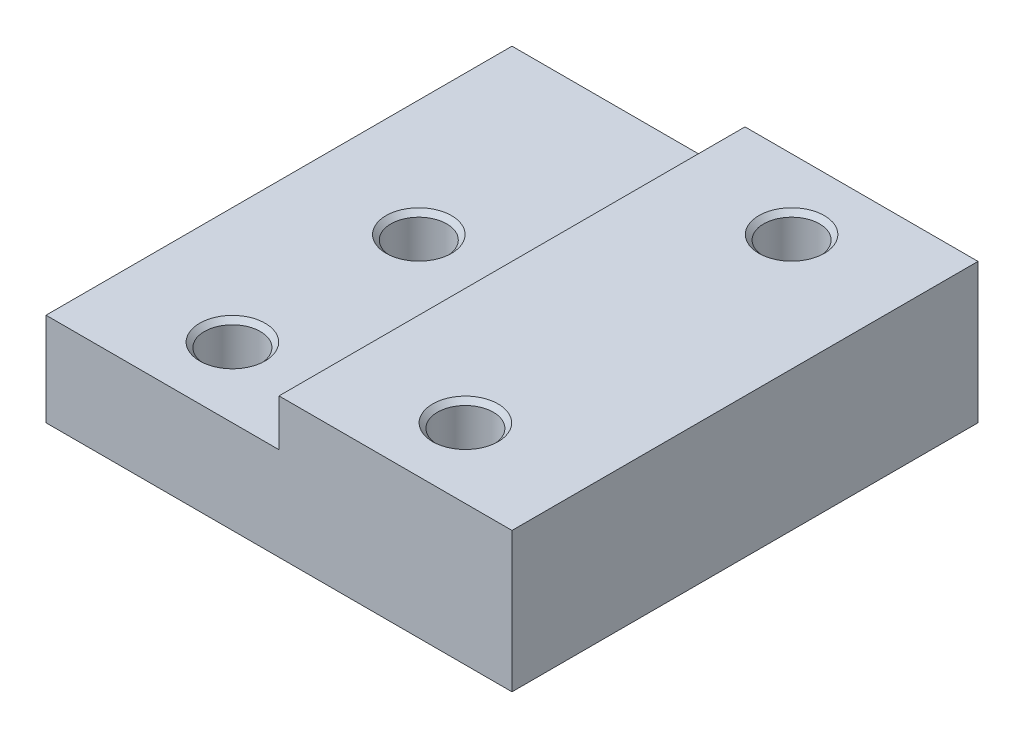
ISO-10303-21;
HEADER;
FILE_DESCRIPTION(('STEP AP214'),'2;1');
FILE_NAME('part.step','',(''),(''),'','','');
FILE_SCHEMA(('AUTOMOTIVE_DESIGN { 1 0 10303 214 1 1 1 1 }'));
ENDSEC;
DATA;
#1=APPLICATION_CONTEXT('core data for automotive mechanical design processes');
#2=APPLICATION_PROTOCOL_DEFINITION('international standard','automotive_design',2000,#1);
#3=PRODUCT_CONTEXT('',#1,'mechanical');
#4=PRODUCT('Part','Part','',(#3));
#5=PRODUCT_RELATED_PRODUCT_CATEGORY('part','',(#4));
#6=PRODUCT_DEFINITION_FORMATION('','',#4);
#7=PRODUCT_DEFINITION_CONTEXT('part definition',#1,'design');
#8=PRODUCT_DEFINITION('design','',#6,#7);
#9=PRODUCT_DEFINITION_SHAPE('','',#8);
#10=(LENGTH_UNIT() NAMED_UNIT(*) SI_UNIT(.MILLI.,.METRE.));
#11=(NAMED_UNIT(*) PLANE_ANGLE_UNIT() SI_UNIT($,.RADIAN.));
#12=(NAMED_UNIT(*) SI_UNIT($,.STERADIAN.) SOLID_ANGLE_UNIT());
#13=UNCERTAINTY_MEASURE_WITH_UNIT(LENGTH_MEASURE(1.E-05),#10,'distance_accuracy_value','');
#14=(GEOMETRIC_REPRESENTATION_CONTEXT(3) GLOBAL_UNCERTAINTY_ASSIGNED_CONTEXT((#13)) GLOBAL_UNIT_ASSIGNED_CONTEXT((#10,
#11,#12)) REPRESENTATION_CONTEXT('',''));
#15=CARTESIAN_POINT('',(0.,0.,0.));
#16=DIRECTION('',(0.,0.,1.));
#17=DIRECTION('',(1.,0.,0.));
#18=AXIS2_PLACEMENT_3D('',#15,#16,#17);
#19=CARTESIAN_POINT('',(0.,20.,100.));
#20=DIRECTION('',(1.,0.,0.));
#21=DIRECTION('',(0.,0.,-1.));
#22=AXIS2_PLACEMENT_3D('',#19,#20,#21);
#23=PLANE('',#22);
#24=DIRECTION('',(0.,-1.,0.));
#25=VECTOR('',#24,1.);
#26=CARTESIAN_POINT('',(0.,20.,0.));
#27=LINE('',#26,#25);
#28=CARTESIAN_POINT('',(0.,20.,0.));
#29=VERTEX_POINT('',#28);
#30=CARTESIAN_POINT('',(0.,0.,0.));
#31=VERTEX_POINT('',#30);
#32=EDGE_CURVE('E126',#29,#31,#27,.T.);
#33=ORIENTED_EDGE('',*,*,#32,.T.);
#34=DIRECTION('',(0.,0.,-1.));
#35=VECTOR('',#34,1.);
#36=CARTESIAN_POINT('',(0.,0.,100.));
#37=LINE('',#36,#35);
#38=CARTESIAN_POINT('',(0.,0.,100.));
#39=VERTEX_POINT('',#38);
#40=EDGE_CURVE('E11',#39,#31,#37,.T.);
#41=ORIENTED_EDGE('',*,*,#40,.F.);
#42=DIRECTION('',(0.,-1.,0.));
#43=VECTOR('',#42,1.);
#44=CARTESIAN_POINT('',(0.,20.,100.));
#45=LINE('',#44,#43);
#46=CARTESIAN_POINT('',(0.,20.,100.));
#47=VERTEX_POINT('',#46);
#48=EDGE_CURVE('E137',#47,#39,#45,.T.);
#49=ORIENTED_EDGE('',*,*,#48,.F.);
#50=DIRECTION('',(0.,0.,-1.));
#51=VECTOR('',#50,1.);
#52=CARTESIAN_POINT('',(0.,20.,100.));
#53=LINE('',#52,#51);
#54=EDGE_CURVE('E122',#47,#29,#53,.T.);
#55=ORIENTED_EDGE('',*,*,#54,.T.);
#56=EDGE_LOOP('',(#33,#41,#49,#55));
#57=FACE_BOUND('',#56,.T.);
#58=ADVANCED_FACE('F39',(#57),#23,.F.);
#59=CARTESIAN_POINT('',(0.,0.,100.));
#60=DIRECTION('',(0.,1.,0.));
#61=DIRECTION('',(0.,0.,1.));
#62=AXIS2_PLACEMENT_3D('',#59,#60,#61);
#63=PLANE('',#62);
#64=CARTESIAN_POINT('',(25.,0.,85.));
#65=DIRECTION('',(0.,1.,0.));
#66=DIRECTION('',(0.,0.,1.));
#67=AXIS2_PLACEMENT_3D('',#64,#65,#66);
#68=CIRCLE('',#67,5.99999999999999);
#69=CARTESIAN_POINT('',(25.,0.,91.));
#70=VERTEX_POINT('',#69);
#71=EDGE_CURVE('E365',#70,#70,#68,.T.);
#72=ORIENTED_EDGE('',*,*,#71,.T.);
#73=EDGE_LOOP('',(#72));
#74=FACE_BOUND('',#73,.T.);
#75=CARTESIAN_POINT('',(25.,0.,45.));
#76=DIRECTION('',(0.,1.,0.));
#77=DIRECTION('',(0.,0.,1.));
#78=AXIS2_PLACEMENT_3D('',#75,#76,#77);
#79=CIRCLE('',#78,5.99999999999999);
#80=CARTESIAN_POINT('',(25.,0.,51.));
#81=VERTEX_POINT('',#80);
#82=EDGE_CURVE('E375',#81,#81,#79,.T.);
#83=ORIENTED_EDGE('',*,*,#82,.T.);
#84=EDGE_LOOP('',(#83));
#85=FACE_BOUND('',#84,.T.);
#86=DIRECTION('',(1.,0.,0.));
#87=VECTOR('',#86,1.);
#88=CARTESIAN_POINT('',(0.,0.,0.));
#89=LINE('',#88,#87);
#90=CARTESIAN_POINT('',(100.,0.,0.));
#91=VERTEX_POINT('',#90);
#92=EDGE_CURVE('E129',#31,#91,#89,.T.);
#93=ORIENTED_EDGE('',*,*,#92,.T.);
#94=DIRECTION('',(0.,0.,-1.));
#95=VECTOR('',#94,1.);
#96=CARTESIAN_POINT('',(100.,0.,100.));
#97=LINE('',#96,#95);
#98=CARTESIAN_POINT('',(100.,0.,100.));
#99=VERTEX_POINT('',#98);
#100=EDGE_CURVE('E47',#99,#91,#97,.T.);
#101=ORIENTED_EDGE('',*,*,#100,.F.);
#102=DIRECTION('',(1.,0.,0.));
#103=VECTOR('',#102,1.);
#104=CARTESIAN_POINT('',(0.,0.,100.));
#105=LINE('',#104,#103);
#106=EDGE_CURVE('E93',#39,#99,#105,.T.);
#107=ORIENTED_EDGE('',*,*,#106,.F.);
#108=ORIENTED_EDGE('',*,*,#40,.T.);
#109=EDGE_LOOP('',(#93,#101,#107,#108));
#110=FACE_BOUND('',#109,.T.);
#111=ADVANCED_FACE('F164',(#74,#85,#110),#63,.F.);
#112=CARTESIAN_POINT('',(100.,0.,100.));
#113=DIRECTION('',(-1.,0.,0.));
#114=DIRECTION('',(0.,0.,1.));
#115=AXIS2_PLACEMENT_3D('',#112,#113,#114);
#116=PLANE('',#115);
#117=DIRECTION('',(0.,1.,0.));
#118=VECTOR('',#117,1.);
#119=CARTESIAN_POINT('',(100.,0.,0.));
#120=LINE('',#119,#118);
#121=CARTESIAN_POINT('',(100.,30.,0.));
#122=VERTEX_POINT('',#121);
#123=EDGE_CURVE('E132',#91,#122,#120,.T.);
#124=ORIENTED_EDGE('',*,*,#123,.T.);
#125=DIRECTION('',(0.,0.,-1.));
#126=VECTOR('',#125,1.);
#127=CARTESIAN_POINT('',(100.,30.,100.));
#128=LINE('',#127,#126);
#129=CARTESIAN_POINT('',(100.,30.,100.));
#130=VERTEX_POINT('',#129);
#131=EDGE_CURVE('E117',#130,#122,#128,.T.);
#132=ORIENTED_EDGE('',*,*,#131,.F.);
#133=DIRECTION('',(0.,1.,0.));
#134=VECTOR('',#133,1.);
#135=CARTESIAN_POINT('',(100.,0.,100.));
#136=LINE('',#135,#134);
#137=EDGE_CURVE('E108',#99,#130,#136,.T.);
#138=ORIENTED_EDGE('',*,*,#137,.F.);
#139=ORIENTED_EDGE('',*,*,#100,.T.);
#140=EDGE_LOOP('',(#124,#132,#138,#139));
#141=FACE_BOUND('',#140,.T.);
#142=ADVANCED_FACE('F143',(#141),#116,.F.);
#143=CARTESIAN_POINT('',(100.,30.,100.));
#144=DIRECTION('',(0.,-1.,0.));
#145=DIRECTION('',(1.,0.,0.));
#146=AXIS2_PLACEMENT_3D('',#143,#144,#145);
#147=PLANE('',#146);
#148=CARTESIAN_POINT('',(75.,30.,15.));
#149=DIRECTION('',(0.,1.,0.));
#150=DIRECTION('',(0.,0.,1.));
#151=AXIS2_PLACEMENT_3D('',#148,#149,#150);
#152=CIRCLE('',#151,7.025);
#153=CARTESIAN_POINT('',(75.,30.,22.025));
#154=VERTEX_POINT('',#153);
#155=EDGE_CURVE('E183',#154,#154,#152,.T.);
#156=ORIENTED_EDGE('',*,*,#155,.F.);
#157=EDGE_LOOP('',(#156));
#158=FACE_BOUND('',#157,.T.);
#159=CARTESIAN_POINT('',(75.,30.,85.));
#160=DIRECTION('',(0.,1.,0.));
#161=DIRECTION('',(0.,0.,1.));
#162=AXIS2_PLACEMENT_3D('',#159,#160,#161);
#163=CIRCLE('',#162,7.025);
#164=CARTESIAN_POINT('',(75.,30.,92.025));
#165=VERTEX_POINT('',#164);
#166=EDGE_CURVE('E186',#165,#165,#163,.T.);
#167=ORIENTED_EDGE('',*,*,#166,.F.);
#168=EDGE_LOOP('',(#167));
#169=FACE_BOUND('',#168,.T.);
#170=DIRECTION('',(-1.,0.,0.));
#171=VECTOR('',#170,1.);
#172=CARTESIAN_POINT('',(100.,30.,0.));
#173=LINE('',#172,#171);
#174=CARTESIAN_POINT('',(50.,30.,0.));
#175=VERTEX_POINT('',#174);
#176=EDGE_CURVE('E116',#122,#175,#173,.T.);
#177=ORIENTED_EDGE('',*,*,#176,.T.);
#178=DIRECTION('',(0.,0.,-1.));
#179=VECTOR('',#178,1.);
#180=CARTESIAN_POINT('',(50.,30.,100.));
#181=LINE('',#180,#179);
#182=CARTESIAN_POINT('',(50.,30.,100.));
#183=VERTEX_POINT('',#182);
#184=EDGE_CURVE('E113',#183,#175,#181,.T.);
#185=ORIENTED_EDGE('',*,*,#184,.F.);
#186=DIRECTION('',(-1.,0.,0.));
#187=VECTOR('',#186,1.);
#188=CARTESIAN_POINT('',(100.,30.,100.));
#189=LINE('',#188,#187);
#190=EDGE_CURVE('E102',#130,#183,#189,.T.);
#191=ORIENTED_EDGE('',*,*,#190,.F.);
#192=ORIENTED_EDGE('',*,*,#131,.T.);
#193=EDGE_LOOP('',(#177,#185,#191,#192));
#194=FACE_BOUND('',#193,.T.);
#195=ADVANCED_FACE('F114',(#158,#169,#194),#147,.F.);
#196=CARTESIAN_POINT('',(50.,30.,100.));
#197=DIRECTION('',(1.,0.,0.));
#198=DIRECTION('',(0.,0.,-1.));
#199=AXIS2_PLACEMENT_3D('',#196,#197,#198);
#200=PLANE('',#199);
#201=DIRECTION('',(0.,-1.,0.));
#202=VECTOR('',#201,1.);
#203=CARTESIAN_POINT('',(50.,30.,0.));
#204=LINE('',#203,#202);
#205=CARTESIAN_POINT('',(50.,20.,0.));
#206=VERTEX_POINT('',#205);
#207=EDGE_CURVE('E79',#175,#206,#204,.T.);
#208=ORIENTED_EDGE('',*,*,#207,.T.);
#209=DIRECTION('',(0.,0.,-1.));
#210=VECTOR('',#209,1.);
#211=CARTESIAN_POINT('',(50.,20.,100.));
#212=LINE('',#211,#210);
#213=CARTESIAN_POINT('',(50.,20.,100.));
#214=VERTEX_POINT('',#213);
#215=EDGE_CURVE('E118',#214,#206,#212,.T.);
#216=ORIENTED_EDGE('',*,*,#215,.F.);
#217=DIRECTION('',(0.,-1.,0.));
#218=VECTOR('',#217,1.);
#219=CARTESIAN_POINT('',(50.,30.,100.));
#220=LINE('',#219,#218);
#221=EDGE_CURVE('E106',#183,#214,#220,.T.);
#222=ORIENTED_EDGE('',*,*,#221,.F.);
#223=ORIENTED_EDGE('',*,*,#184,.T.);
#224=EDGE_LOOP('',(#208,#216,#222,#223));
#225=FACE_BOUND('',#224,.T.);
#226=ADVANCED_FACE('F120',(#225),#200,.F.);
#227=CARTESIAN_POINT('',(50.,20.,100.));
#228=DIRECTION('',(0.,-1.,0.));
#229=DIRECTION('',(1.,0.,0.));
#230=AXIS2_PLACEMENT_3D('',#227,#228,#229);
#231=PLANE('',#230);
#232=CARTESIAN_POINT('',(25.,20.,85.));
#233=DIRECTION('',(0.,1.,0.));
#234=DIRECTION('',(0.,0.,1.));
#235=AXIS2_PLACEMENT_3D('',#232,#233,#234);
#236=CIRCLE('',#235,7.025);
#237=CARTESIAN_POINT('',(25.,20.,92.025));
#238=VERTEX_POINT('',#237);
#239=EDGE_CURVE('E363',#238,#238,#236,.T.);
#240=ORIENTED_EDGE('',*,*,#239,.F.);
#241=EDGE_LOOP('',(#240));
#242=FACE_BOUND('',#241,.T.);
#243=CARTESIAN_POINT('',(25.,20.,45.));
#244=DIRECTION('',(0.,1.,0.));
#245=DIRECTION('',(0.,0.,1.));
#246=AXIS2_PLACEMENT_3D('',#243,#244,#245);
#247=CIRCLE('',#246,7.025);
#248=CARTESIAN_POINT('',(25.,20.,52.025));
#249=VERTEX_POINT('',#248);
#250=EDGE_CURVE('E369',#249,#249,#247,.T.);
#251=ORIENTED_EDGE('',*,*,#250,.F.);
#252=EDGE_LOOP('',(#251));
#253=FACE_BOUND('',#252,.T.);
#254=DIRECTION('',(-1.,0.,0.));
#255=VECTOR('',#254,1.);
#256=CARTESIAN_POINT('',(50.,20.,0.));
#257=LINE('',#256,#255);
#258=EDGE_CURVE('E85',#206,#29,#257,.T.);
#259=ORIENTED_EDGE('',*,*,#258,.T.);
#260=ORIENTED_EDGE('',*,*,#54,.F.);
#261=DIRECTION('',(-1.,0.,0.));
#262=VECTOR('',#261,1.);
#263=CARTESIAN_POINT('',(50.,20.,100.));
#264=LINE('',#263,#262);
#265=EDGE_CURVE('E55',#214,#47,#264,.T.);
#266=ORIENTED_EDGE('',*,*,#265,.F.);
#267=ORIENTED_EDGE('',*,*,#215,.T.);
#268=EDGE_LOOP('',(#259,#260,#266,#267));
#269=FACE_BOUND('',#268,.T.);
#270=ADVANCED_FACE('F150',(#242,#253,#269),#231,.F.);
#271=CARTESIAN_POINT('',(0.,0.,100.));
#272=DIRECTION('',(0.,0.,1.));
#273=DIRECTION('',(1.,0.,0.));
#274=AXIS2_PLACEMENT_3D('',#271,#272,#273);
#275=PLANE('',#274);
#276=ORIENTED_EDGE('',*,*,#48,.T.);
#277=ORIENTED_EDGE('',*,*,#106,.T.);
#278=ORIENTED_EDGE('',*,*,#137,.T.);
#279=ORIENTED_EDGE('',*,*,#190,.T.);
#280=ORIENTED_EDGE('',*,*,#221,.T.);
#281=ORIENTED_EDGE('',*,*,#265,.T.);
#282=EDGE_LOOP('',(#276,#277,#278,#279,#280,#281));
#283=FACE_BOUND('',#282,.T.);
#284=ADVANCED_FACE('F104',(#283),#275,.T.);
#285=CARTESIAN_POINT('',(0.,0.,0.));
#286=DIRECTION('',(0.,0.,1.));
#287=DIRECTION('',(1.,0.,0.));
#288=AXIS2_PLACEMENT_3D('',#285,#286,#287);
#289=PLANE('',#288);
#290=ORIENTED_EDGE('',*,*,#32,.F.);
#291=ORIENTED_EDGE('',*,*,#258,.F.);
#292=ORIENTED_EDGE('',*,*,#207,.F.);
#293=ORIENTED_EDGE('',*,*,#176,.F.);
#294=ORIENTED_EDGE('',*,*,#123,.F.);
#295=ORIENTED_EDGE('',*,*,#92,.F.);
#296=EDGE_LOOP('',(#290,#291,#292,#293,#294,#295));
#297=FACE_BOUND('',#296,.T.);
#298=ADVANCED_FACE('F146',(#297),#289,.F.);
#299=CARTESIAN_POINT('',(75.,9.99999999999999,85.));
#300=DIRECTION('',(0.,1.,0.));
#301=DIRECTION('',(0.,0.,1.));
#302=AXIS2_PLACEMENT_3D('',#299,#300,#301);
#303=CONICAL_SURFACE('',#302,5.99999999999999,1.02974425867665);
#304=CARTESIAN_POINT('',(75.,6.39483628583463,85.));
#305=VERTEX_POINT('',#304);
#306=VERTEX_LOOP('',#305);
#307=FACE_BOUND('',#306,.T.);
#308=CARTESIAN_POINT('',(75.,9.99999999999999,85.));
#309=DIRECTION('',(0.,1.,0.));
#310=DIRECTION('',(0.,0.,1.));
#311=AXIS2_PLACEMENT_3D('',#308,#309,#310);
#312=CIRCLE('',#311,5.99999999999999);
#313=CARTESIAN_POINT('',(75.,9.99999999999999,91.));
#314=VERTEX_POINT('',#313);
#315=EDGE_CURVE('E130',#314,#314,#312,.T.);
#316=ORIENTED_EDGE('',*,*,#315,.T.);
#317=EDGE_LOOP('',(#316));
#318=FACE_BOUND('',#317,.T.);
#319=ADVANCED_FACE('F203',(#307,#318),#303,.F.);
#320=CARTESIAN_POINT('',(75.,30.,85.));
#321=DIRECTION('',(0.,1.,0.));
#322=DIRECTION('',(0.,0.,1.));
#323=AXIS2_PLACEMENT_3D('',#320,#321,#322);
#324=CYLINDRICAL_SURFACE('',#323,5.99999999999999);
#325=ORIENTED_EDGE('',*,*,#315,.F.);
#326=EDGE_LOOP('',(#325));
#327=FACE_BOUND('',#326,.T.);
#328=CARTESIAN_POINT('',(75.,28.975,85.));
#329=DIRECTION('',(0.,1.,0.));
#330=DIRECTION('',(0.,0.,1.));
#331=AXIS2_PLACEMENT_3D('',#328,#329,#330);
#332=CIRCLE('',#331,5.99999999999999);
#333=CARTESIAN_POINT('',(75.,28.975,91.));
#334=VERTEX_POINT('',#333);
#335=EDGE_CURVE('E188',#334,#334,#332,.T.);
#336=ORIENTED_EDGE('',*,*,#335,.T.);
#337=EDGE_LOOP('',(#336));
#338=FACE_BOUND('',#337,.T.);
#339=ADVANCED_FACE('F205',(#327,#338),#324,.F.);
#340=CARTESIAN_POINT('',(75.,30.,85.));
#341=DIRECTION('',(0.,1.,0.));
#342=DIRECTION('',(0.,0.,1.));
#343=AXIS2_PLACEMENT_3D('',#340,#341,#342);
#344=CONICAL_SURFACE('',#343,7.025,0.785398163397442);
#345=ORIENTED_EDGE('',*,*,#335,.F.);
#346=EDGE_LOOP('',(#345));
#347=FACE_BOUND('',#346,.T.);
#348=ORIENTED_EDGE('',*,*,#166,.T.);
#349=EDGE_LOOP('',(#348));
#350=FACE_BOUND('',#349,.T.);
#351=ADVANCED_FACE('F208',(#347,#350),#344,.F.);
#352=CARTESIAN_POINT('',(75.,9.99999999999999,15.));
#353=DIRECTION('',(0.,1.,0.));
#354=DIRECTION('',(0.,0.,1.));
#355=AXIS2_PLACEMENT_3D('',#352,#353,#354);
#356=CONICAL_SURFACE('',#355,5.99999999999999,1.02974425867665);
#357=CARTESIAN_POINT('',(75.,6.39483628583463,15.));
#358=VERTEX_POINT('',#357);
#359=VERTEX_LOOP('',#358);
#360=FACE_BOUND('',#359,.T.);
#361=CARTESIAN_POINT('',(75.,9.99999999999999,15.));
#362=DIRECTION('',(0.,1.,0.));
#363=DIRECTION('',(0.,0.,1.));
#364=AXIS2_PLACEMENT_3D('',#361,#362,#363);
#365=CIRCLE('',#364,5.99999999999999);
#366=CARTESIAN_POINT('',(75.,9.99999999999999,21.));
#367=VERTEX_POINT('',#366);
#368=EDGE_CURVE('E189',#367,#367,#365,.T.);
#369=ORIENTED_EDGE('',*,*,#368,.T.);
#370=EDGE_LOOP('',(#369));
#371=FACE_BOUND('',#370,.T.);
#372=ADVANCED_FACE('F213',(#360,#371),#356,.F.);
#373=CARTESIAN_POINT('',(75.,30.,15.));
#374=DIRECTION('',(0.,1.,0.));
#375=DIRECTION('',(0.,0.,1.));
#376=AXIS2_PLACEMENT_3D('',#373,#374,#375);
#377=CYLINDRICAL_SURFACE('',#376,5.99999999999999);
#378=ORIENTED_EDGE('',*,*,#368,.F.);
#379=EDGE_LOOP('',(#378));
#380=FACE_BOUND('',#379,.T.);
#381=CARTESIAN_POINT('',(75.,28.975,15.));
#382=DIRECTION('',(0.,1.,0.));
#383=DIRECTION('',(0.,0.,1.));
#384=AXIS2_PLACEMENT_3D('',#381,#382,#383);
#385=CIRCLE('',#384,5.99999999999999);
#386=CARTESIAN_POINT('',(75.,28.975,21.));
#387=VERTEX_POINT('',#386);
#388=EDGE_CURVE('E194',#387,#387,#385,.T.);
#389=ORIENTED_EDGE('',*,*,#388,.T.);
#390=EDGE_LOOP('',(#389));
#391=FACE_BOUND('',#390,.T.);
#392=ADVANCED_FACE('F218',(#380,#391),#377,.F.);
#393=CARTESIAN_POINT('',(75.,30.,15.));
#394=DIRECTION('',(0.,1.,0.));
#395=DIRECTION('',(0.,0.,1.));
#396=AXIS2_PLACEMENT_3D('',#393,#394,#395);
#397=CONICAL_SURFACE('',#396,7.025,0.785398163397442);
#398=ORIENTED_EDGE('',*,*,#388,.F.);
#399=EDGE_LOOP('',(#398));
#400=FACE_BOUND('',#399,.T.);
#401=ORIENTED_EDGE('',*,*,#155,.T.);
#402=EDGE_LOOP('',(#401));
#403=FACE_BOUND('',#402,.T.);
#404=ADVANCED_FACE('F247',(#400,#403),#397,.F.);
#405=CARTESIAN_POINT('',(25.,20.,45.));
#406=DIRECTION('',(0.,1.,0.));
#407=DIRECTION('',(0.,0.,1.));
#408=AXIS2_PLACEMENT_3D('',#405,#406,#407);
#409=CYLINDRICAL_SURFACE('',#408,6.);
#410=ORIENTED_EDGE('',*,*,#82,.F.);
#411=EDGE_LOOP('',(#410));
#412=FACE_BOUND('',#411,.T.);
#413=CARTESIAN_POINT('',(25.,18.975,45.));
#414=DIRECTION('',(0.,1.,0.));
#415=DIRECTION('',(0.,0.,1.));
#416=AXIS2_PLACEMENT_3D('',#413,#414,#415);
#417=CIRCLE('',#416,6.);
#418=CARTESIAN_POINT('',(25.,18.975,51.));
#419=VERTEX_POINT('',#418);
#420=EDGE_CURVE('E372',#419,#419,#417,.T.);
#421=ORIENTED_EDGE('',*,*,#420,.T.);
#422=EDGE_LOOP('',(#421));
#423=FACE_BOUND('',#422,.T.);
#424=ADVANCED_FACE('F258',(#412,#423),#409,.F.);
#425=CARTESIAN_POINT('',(25.,20.,45.));
#426=DIRECTION('',(0.,1.,0.));
#427=DIRECTION('',(0.,0.,1.));
#428=AXIS2_PLACEMENT_3D('',#425,#426,#427);
#429=CONICAL_SURFACE('',#428,7.025,0.785398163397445);
#430=ORIENTED_EDGE('',*,*,#420,.F.);
#431=EDGE_LOOP('',(#430));
#432=FACE_BOUND('',#431,.T.);
#433=ORIENTED_EDGE('',*,*,#250,.T.);
#434=EDGE_LOOP('',(#433));
#435=FACE_BOUND('',#434,.T.);
#436=ADVANCED_FACE('F265',(#432,#435),#429,.F.);
#437=CARTESIAN_POINT('',(25.,20.,85.));
#438=DIRECTION('',(0.,1.,0.));
#439=DIRECTION('',(0.,0.,1.));
#440=AXIS2_PLACEMENT_3D('',#437,#438,#439);
#441=CYLINDRICAL_SURFACE('',#440,6.);
#442=ORIENTED_EDGE('',*,*,#71,.F.);
#443=EDGE_LOOP('',(#442));
#444=FACE_BOUND('',#443,.T.);
#445=CARTESIAN_POINT('',(25.,18.975,85.));
#446=DIRECTION('',(0.,1.,0.));
#447=DIRECTION('',(0.,0.,1.));
#448=AXIS2_PLACEMENT_3D('',#445,#446,#447);
#449=CIRCLE('',#448,6.);
#450=CARTESIAN_POINT('',(25.,18.975,91.));
#451=VERTEX_POINT('',#450);
#452=EDGE_CURVE('E361',#451,#451,#449,.T.);
#453=ORIENTED_EDGE('',*,*,#452,.T.);
#454=EDGE_LOOP('',(#453));
#455=FACE_BOUND('',#454,.T.);
#456=ADVANCED_FACE('F274',(#444,#455),#441,.F.);
#457=CARTESIAN_POINT('',(25.,20.,85.));
#458=DIRECTION('',(0.,1.,0.));
#459=DIRECTION('',(0.,0.,1.));
#460=AXIS2_PLACEMENT_3D('',#457,#458,#459);
#461=CONICAL_SURFACE('',#460,7.025,0.785398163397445);
#462=ORIENTED_EDGE('',*,*,#452,.F.);
#463=EDGE_LOOP('',(#462));
#464=FACE_BOUND('',#463,.T.);
#465=ORIENTED_EDGE('',*,*,#239,.T.);
#466=EDGE_LOOP('',(#465));
#467=FACE_BOUND('',#466,.T.);
#468=ADVANCED_FACE('F282',(#464,#467),#461,.F.);
#469=CLOSED_SHELL('',(#58,#111,#142,#195,#226,#270,#284,#298,#319,#339,#351,#372,#392,#404,#424,
#436,#456,#468));
#470=MANIFOLD_SOLID_BREP('B2',#469);
#471=ADVANCED_BREP_SHAPE_REPRESENTATION('',(#18,#470),#14);
#472=SHAPE_DEFINITION_REPRESENTATION(#9,#471);
ENDSEC;
END-ISO-10303-21;
